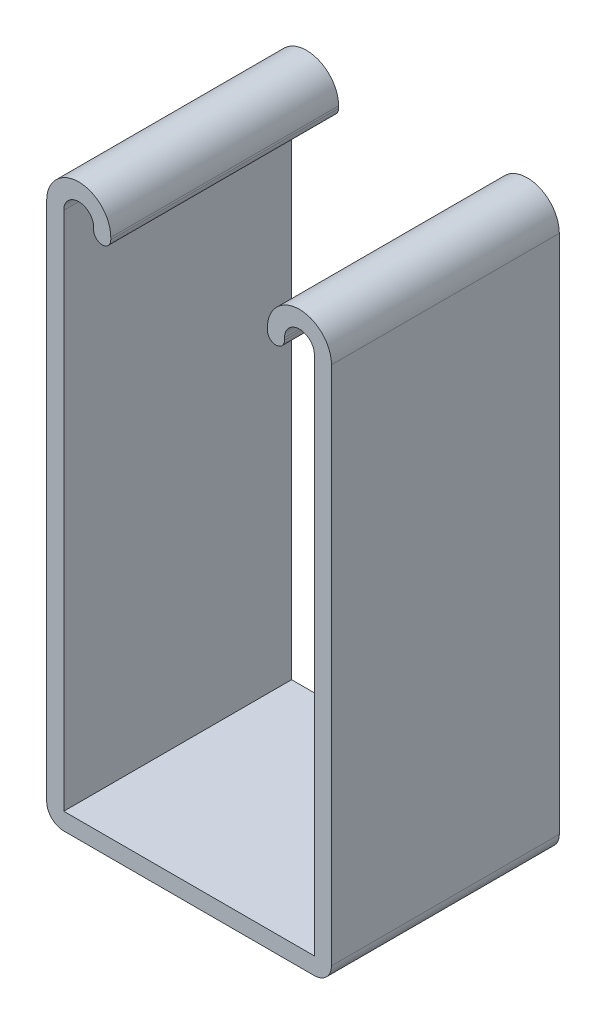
from build123d import *

# Parameters (mm, degrees)
BASE_EXTRUDE_DEPTH = 12.7


with BuildPart() as part:
    # Sketch1 → Base-Extrude (new, symmetric)
    with BuildSketch(Plane.XY):
        with BuildLine():
            Line((-15.875, 30.692725), (-15.875, -27.3304))
            ThreePointArc((-15.875, -27.3304), (-15.317038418, -28.677438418), (-13.97, -29.2354))
            Line((-13.97, -29.2354), (13.97, -29.2354))
            ThreePointArc((13.97, -29.2354), (15.317038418, -28.677438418), (15.875, -27.3304))
            Line((15.875, -27.3304), (15.875, 30.692725))
            ThreePointArc((15.875, 30.692725), (12.303125, 34.2646), (8.73125, 30.692725))
            Line((8.73125, 30.692725), (8.73125, 30.4546))
            ThreePointArc((8.73125, 30.4546), (9.68375, 29.5021), (10.63625, 30.4546))
            Line((10.63625, 30.4546), (10.63625, 30.692725))
            ThreePointArc((10.63625, 30.692725), (12.303125, 32.3596), (13.97, 30.692725))
            Line((13.97, 30.692725), (13.97, -27.3304))
            Line((13.97, -27.3304), (-13.97, -27.3304))
            Line((-13.97, -27.3304), (-13.97, 30.692725))
            ThreePointArc((-13.97, 30.692725), (-12.303125, 32.3596), (-10.63625, 30.692725))
            Line((-10.63625, 30.692725), (-10.63625, 30.4546))
            ThreePointArc((-10.63625, 30.4546), (-9.68375, 29.5021), (-8.73125, 30.4546))
            Line((-8.73125, 30.4546), (-8.73125, 30.692725))
            ThreePointArc((-8.73125, 30.692725), (-12.303125, 34.2646), (-15.875, 30.692725))
        make_face()
    extrude(amount=BASE_EXTRUDE_DEPTH, both=True)


solid = part.part
